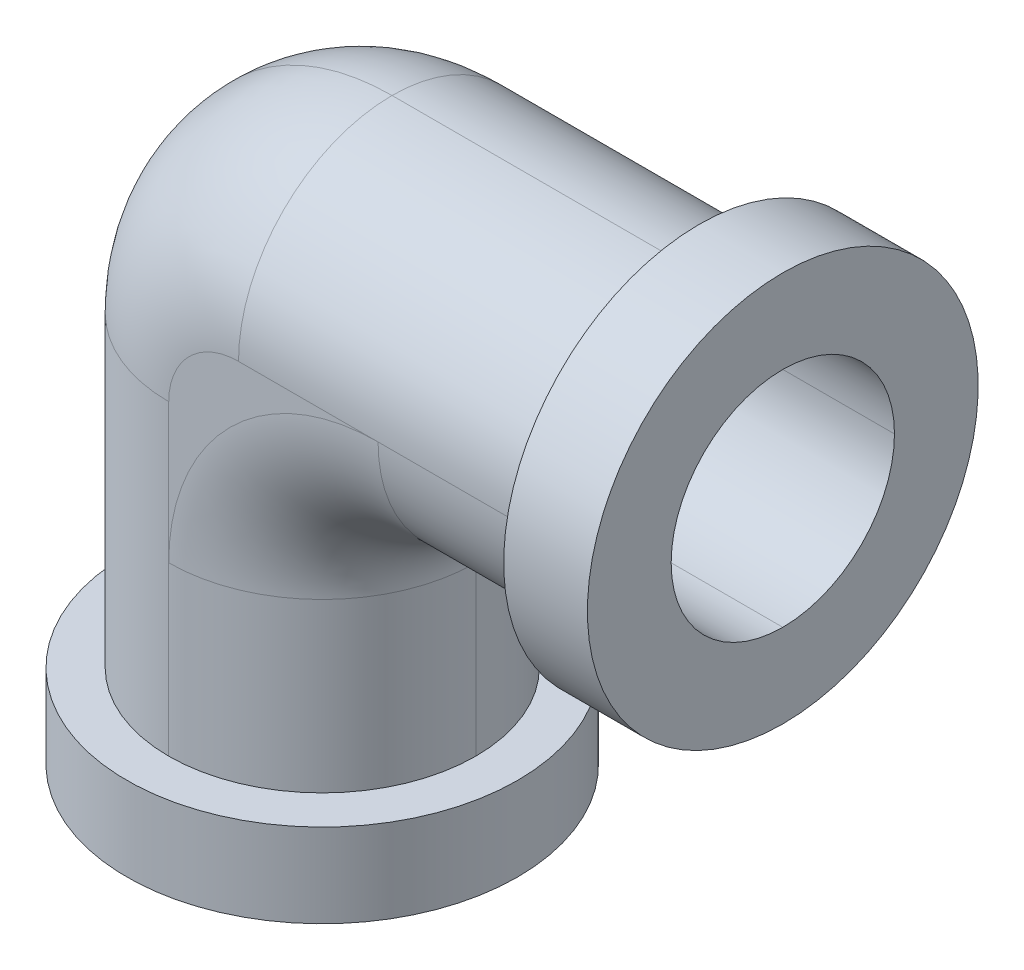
ISO-10303-21;
HEADER;
FILE_DESCRIPTION(('STEP AP214'),'2;1');
FILE_NAME('part.step','',(''),(''),'','','');
FILE_SCHEMA(('AUTOMOTIVE_DESIGN { 1 0 10303 214 1 1 1 1 }'));
ENDSEC;
DATA;
#1=APPLICATION_CONTEXT('core data for automotive mechanical design processes');
#2=APPLICATION_PROTOCOL_DEFINITION('international standard','automotive_design',2000,#1);
#3=PRODUCT_CONTEXT('',#1,'mechanical');
#4=PRODUCT('Part','Part','',(#3));
#5=PRODUCT_RELATED_PRODUCT_CATEGORY('part','',(#4));
#6=PRODUCT_DEFINITION_FORMATION('','',#4);
#7=PRODUCT_DEFINITION_CONTEXT('part definition',#1,'design');
#8=PRODUCT_DEFINITION('design','',#6,#7);
#9=PRODUCT_DEFINITION_SHAPE('','',#8);
#10=(LENGTH_UNIT() NAMED_UNIT(*) SI_UNIT(.MILLI.,.METRE.));
#11=(NAMED_UNIT(*) PLANE_ANGLE_UNIT() SI_UNIT($,.RADIAN.));
#12=(NAMED_UNIT(*) SI_UNIT($,.STERADIAN.) SOLID_ANGLE_UNIT());
#13=UNCERTAINTY_MEASURE_WITH_UNIT(LENGTH_MEASURE(1.E-05),#10,'distance_accuracy_value','');
#14=(GEOMETRIC_REPRESENTATION_CONTEXT(3) GLOBAL_UNCERTAINTY_ASSIGNED_CONTEXT((#13)) GLOBAL_UNIT_ASSIGNED_CONTEXT((#10,
#11,#12)) REPRESENTATION_CONTEXT('',''));
#15=CARTESIAN_POINT('',(0.,0.,0.));
#16=DIRECTION('',(0.,0.,1.));
#17=DIRECTION('',(1.,0.,0.));
#18=AXIS2_PLACEMENT_3D('',#15,#16,#17);
#19=CARTESIAN_POINT('',(5.5,14.,5.5));
#20=DIRECTION('',(0.,-1.,0.));
#21=DIRECTION('',(0.,0.,-1.));
#22=AXIS2_PLACEMENT_3D('',#19,#20,#21);
#23=CYLINDRICAL_SURFACE('',#22,5.5);
#24=DIRECTION('',(0.,-1.,0.));
#25=VECTOR('',#24,1.);
#26=CARTESIAN_POINT('',(0.,0.,5.5));
#27=LINE('',#26,#25);
#28=CARTESIAN_POINT('',(0.,3.,5.5));
#29=VERTEX_POINT('',#28);
#30=CARTESIAN_POINT('',(0.,14.,5.5));
#31=VERTEX_POINT('',#30);
#32=EDGE_CURVE('E205',#29,#31,#27,.F.);
#33=ORIENTED_EDGE('',*,*,#32,.F.);
#34=CARTESIAN_POINT('',(5.5,3.,5.5));
#35=DIRECTION('',(0.,-1.,0.));
#36=DIRECTION('',(1.,0.,0.));
#37=AXIS2_PLACEMENT_3D('',#34,#35,#36);
#38=CIRCLE('',#37,5.5);
#39=CARTESIAN_POINT('',(5.5,3.,11.));
#40=VERTEX_POINT('',#39);
#41=EDGE_CURVE('E184',#40,#29,#38,.T.);
#42=ORIENTED_EDGE('',*,*,#41,.F.);
#43=DIRECTION('',(0.,-1.,0.));
#44=VECTOR('',#43,1.);
#45=CARTESIAN_POINT('',(5.5,14.,11.));
#46=LINE('',#45,#44);
#47=CARTESIAN_POINT('',(5.5,8.99999999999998,11.));
#48=VERTEX_POINT('',#47);
#49=EDGE_CURVE('E182',#48,#40,#46,.T.);
#50=ORIENTED_EDGE('',*,*,#49,.F.);
#51=DIRECTION('',(0.,-1.,0.));
#52=VECTOR('',#51,1.);
#53=CARTESIAN_POINT('',(5.5,14.,11.));
#54=LINE('',#53,#52);
#55=CARTESIAN_POINT('',(5.5,14.,11.));
#56=VERTEX_POINT('',#55);
#57=EDGE_CURVE('E260',#56,#48,#54,.T.);
#58=ORIENTED_EDGE('',*,*,#57,.F.);
#59=CARTESIAN_POINT('',(5.5,14.,5.5));
#60=DIRECTION('',(0.,-1.,0.));
#61=DIRECTION('',(0.,0.,-1.));
#62=AXIS2_PLACEMENT_3D('',#59,#60,#61);
#63=CIRCLE('',#62,5.5);
#64=EDGE_CURVE('E218',#56,#31,#63,.T.);
#65=ORIENTED_EDGE('',*,*,#64,.T.);
#66=EDGE_LOOP('',(#33,#42,#50,#58,#65));
#67=FACE_BOUND('',#66,.T.);
#68=ADVANCED_FACE('F33',(#67),#23,.T.);
#69=CARTESIAN_POINT('',(5.5,0.,5.5));
#70=DIRECTION('',(0.,1.,0.));
#71=DIRECTION('',(0.,0.,1.));
#72=AXIS2_PLACEMENT_3D('',#69,#70,#71);
#73=CYLINDRICAL_SURFACE('',#72,5.5);
#74=DIRECTION('',(0.,-1.,0.));
#75=VECTOR('',#74,1.);
#76=CARTESIAN_POINT('',(5.5,14.,0.));
#77=LINE('',#76,#75);
#78=CARTESIAN_POINT('',(5.5,3.,0.));
#79=VERTEX_POINT('',#78);
#80=CARTESIAN_POINT('',(5.5,8.99999999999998,0.));
#81=VERTEX_POINT('',#80);
#82=EDGE_CURVE('E189',#79,#81,#77,.F.);
#83=ORIENTED_EDGE('',*,*,#82,.F.);
#84=EDGE_CURVE('E48',#29,#79,#38,.T.);
#85=ORIENTED_EDGE('',*,*,#84,.F.);
#86=ORIENTED_EDGE('',*,*,#32,.T.);
#87=CARTESIAN_POINT('',(5.5,14.,5.5));
#88=DIRECTION('',(0.,-1.,0.));
#89=DIRECTION('',(0.,0.,-1.));
#90=AXIS2_PLACEMENT_3D('',#87,#88,#89);
#91=CIRCLE('',#90,5.5);
#92=CARTESIAN_POINT('',(5.5,14.,0.));
#93=VERTEX_POINT('',#92);
#94=EDGE_CURVE('E207',#31,#93,#91,.T.);
#95=ORIENTED_EDGE('',*,*,#94,.T.);
#96=DIRECTION('',(0.,-1.,0.));
#97=VECTOR('',#96,1.);
#98=CARTESIAN_POINT('',(5.5,14.,0.));
#99=LINE('',#98,#97);
#100=EDGE_CURVE('E272',#81,#93,#99,.F.);
#101=ORIENTED_EDGE('',*,*,#100,.F.);
#102=EDGE_LOOP('',(#83,#85,#86,#95,#101));
#103=FACE_BOUND('',#102,.T.);
#104=ADVANCED_FACE('F398',(#103),#73,.T.);
#105=CARTESIAN_POINT('',(5.5,14.,5.5));
#106=DIRECTION('',(0.,1.,0.));
#107=DIRECTION('',(-1.,0.,0.));
#108=AXIS2_PLACEMENT_3D('',#105,#106,#107);
#109=CYLINDRICAL_SURFACE('',#108,5.5);
#110=ORIENTED_EDGE('',*,*,#49,.T.);
#111=CARTESIAN_POINT('',(11.,3.,5.5));
#112=VERTEX_POINT('',#111);
#113=EDGE_CURVE('E169',#112,#40,#38,.T.);
#114=ORIENTED_EDGE('',*,*,#113,.F.);
#115=DIRECTION('',(0.,1.,0.));
#116=VECTOR('',#115,1.);
#117=CARTESIAN_POINT('',(11.,8.99999999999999,5.5));
#118=LINE('',#117,#116);
#119=CARTESIAN_POINT('',(11.,8.99999999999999,5.5));
#120=VERTEX_POINT('',#119);
#121=EDGE_CURVE('E179',#120,#112,#118,.F.);
#122=ORIENTED_EDGE('',*,*,#121,.F.);
#123=CARTESIAN_POINT('',(5.5,8.99999999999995,5.5));
#124=DIRECTION('',(0.,-1.,0.));
#125=DIRECTION('',(1.,0.,0.));
#126=AXIS2_PLACEMENT_3D('',#123,#124,#125);
#127=CIRCLE('',#126,5.5);
#128=EDGE_CURVE('E202',#120,#48,#127,.T.);
#129=ORIENTED_EDGE('',*,*,#128,.T.);
#130=EDGE_LOOP('',(#110,#114,#122,#129));
#131=FACE_BOUND('',#130,.T.);
#132=ADVANCED_FACE('F177',(#131),#109,.T.);
#133=CARTESIAN_POINT('',(5.5,8.99999999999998,5.5));
#134=DIRECTION('',(0.,-1.,0.));
#135=DIRECTION('',(1.,0.,0.));
#136=AXIS2_PLACEMENT_3D('',#133,#134,#135);
#137=CYLINDRICAL_SURFACE('',#136,5.5);
#138=ORIENTED_EDGE('',*,*,#121,.T.);
#139=CARTESIAN_POINT('',(5.5,3.,5.5));
#140=DIRECTION('',(0.,-1.,0.));
#141=DIRECTION('',(1.,0.,0.));
#142=AXIS2_PLACEMENT_3D('',#139,#140,#141);
#143=CIRCLE('',#142,5.5);
#144=EDGE_CURVE('E11',#112,#79,#143,.F.);
#145=ORIENTED_EDGE('',*,*,#144,.T.);
#146=ORIENTED_EDGE('',*,*,#82,.T.);
#147=CARTESIAN_POINT('',(5.5,8.99999999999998,5.5));
#148=DIRECTION('',(0.,-1.,0.));
#149=DIRECTION('',(1.,0.,0.));
#150=AXIS2_PLACEMENT_3D('',#147,#148,#149);
#151=CIRCLE('',#150,5.5);
#152=EDGE_CURVE('E188',#81,#120,#151,.T.);
#153=ORIENTED_EDGE('',*,*,#152,.T.);
#154=EDGE_LOOP('',(#138,#145,#146,#153));
#155=FACE_BOUND('',#154,.T.);
#156=ADVANCED_FACE('F186',(#155),#137,.T.);
#157=CARTESIAN_POINT('',(8.,16.5,5.5));
#158=DIRECTION('',(-1.,0.,0.));
#159=DIRECTION('',(0.,-1.,0.));
#160=AXIS2_PLACEMENT_3D('',#157,#158,#159);
#161=CYLINDRICAL_SURFACE('',#160,5.5);
#162=DIRECTION('',(-1.,0.,0.));
#163=VECTOR('',#162,1.);
#164=CARTESIAN_POINT('',(8.,16.5,11.));
#165=LINE('',#164,#163);
#166=CARTESIAN_POINT('',(19.,16.5,11.));
#167=VERTEX_POINT('',#166);
#168=CARTESIAN_POINT('',(13.,16.5,11.));
#169=VERTEX_POINT('',#168);
#170=EDGE_CURVE('E230',#167,#169,#165,.T.);
#171=ORIENTED_EDGE('',*,*,#170,.F.);
#172=CARTESIAN_POINT('',(19.,16.5,5.5));
#173=DIRECTION('',(1.,0.,0.));
#174=DIRECTION('',(0.,1.,0.));
#175=AXIS2_PLACEMENT_3D('',#172,#173,#174);
#176=CIRCLE('',#175,5.5);
#177=CARTESIAN_POINT('',(19.,22.,5.5));
#178=VERTEX_POINT('',#177);
#179=EDGE_CURVE('E345',#178,#167,#176,.T.);
#180=ORIENTED_EDGE('',*,*,#179,.F.);
#181=DIRECTION('',(-1.,0.,0.));
#182=VECTOR('',#181,1.);
#183=CARTESIAN_POINT('',(8.,22.,5.5));
#184=LINE('',#183,#182);
#185=CARTESIAN_POINT('',(8.,22.,5.5));
#186=VERTEX_POINT('',#185);
#187=EDGE_CURVE('E227',#186,#178,#184,.F.);
#188=ORIENTED_EDGE('',*,*,#187,.F.);
#189=CARTESIAN_POINT('',(8.,16.5,5.5));
#190=DIRECTION('',(-1.,0.,0.));
#191=DIRECTION('',(0.,0.,1.));
#192=AXIS2_PLACEMENT_3D('',#189,#190,#191);
#193=CIRCLE('',#192,5.5);
#194=CARTESIAN_POINT('',(8.,16.5,11.));
#195=VERTEX_POINT('',#194);
#196=EDGE_CURVE('E232',#195,#186,#193,.T.);
#197=ORIENTED_EDGE('',*,*,#196,.F.);
#198=DIRECTION('',(-1.,0.,0.));
#199=VECTOR('',#198,1.);
#200=CARTESIAN_POINT('',(8.,16.5,11.));
#201=LINE('',#200,#199);
#202=EDGE_CURVE('E267',#169,#195,#201,.T.);
#203=ORIENTED_EDGE('',*,*,#202,.F.);
#204=EDGE_LOOP('',(#171,#180,#188,#197,#203));
#205=FACE_BOUND('',#204,.T.);
#206=ADVANCED_FACE('F35',(#205),#161,.T.);
#207=CARTESIAN_POINT('',(8.,16.5,5.5));
#208=DIRECTION('',(1.,0.,0.));
#209=DIRECTION('',(0.,1.,0.));
#210=AXIS2_PLACEMENT_3D('',#207,#208,#209);
#211=CYLINDRICAL_SURFACE('',#210,5.5);
#212=DIRECTION('',(1.,0.,0.));
#213=VECTOR('',#212,1.);
#214=CARTESIAN_POINT('',(22.,11.,5.5));
#215=LINE('',#214,#213);
#216=CARTESIAN_POINT('',(19.,11.,5.5));
#217=VERTEX_POINT('',#216);
#218=CARTESIAN_POINT('',(13.,11.,5.5));
#219=VERTEX_POINT('',#218);
#220=EDGE_CURVE('E213',#217,#219,#215,.F.);
#221=ORIENTED_EDGE('',*,*,#220,.F.);
#222=EDGE_CURVE('E55',#167,#217,#176,.T.);
#223=ORIENTED_EDGE('',*,*,#222,.F.);
#224=ORIENTED_EDGE('',*,*,#170,.T.);
#225=CARTESIAN_POINT('',(13.,16.5,5.5));
#226=DIRECTION('',(-1.,0.,0.));
#227=DIRECTION('',(0.,0.,1.));
#228=AXIS2_PLACEMENT_3D('',#225,#226,#227);
#229=CIRCLE('',#228,5.5);
#230=EDGE_CURVE('E215',#219,#169,#229,.T.);
#231=ORIENTED_EDGE('',*,*,#230,.F.);
#232=EDGE_LOOP('',(#221,#223,#224,#231));
#233=FACE_BOUND('',#232,.T.);
#234=ADVANCED_FACE('F388',(#233),#211,.T.);
#235=CARTESIAN_POINT('',(8.,16.5,5.5));
#236=DIRECTION('',(1.,0.,0.));
#237=DIRECTION('',(0.,1.,0.));
#238=AXIS2_PLACEMENT_3D('',#235,#236,#237);
#239=CYLINDRICAL_SURFACE('',#238,5.5);
#240=ORIENTED_EDGE('',*,*,#187,.T.);
#241=CARTESIAN_POINT('',(19.,16.5,0.));
#242=VERTEX_POINT('',#241);
#243=EDGE_CURVE('E349',#242,#178,#176,.T.);
#244=ORIENTED_EDGE('',*,*,#243,.F.);
#245=DIRECTION('',(-1.,0.,0.));
#246=VECTOR('',#245,1.);
#247=CARTESIAN_POINT('',(22.,16.5,0.));
#248=LINE('',#247,#246);
#249=CARTESIAN_POINT('',(13.,16.5,0.));
#250=VERTEX_POINT('',#249);
#251=EDGE_CURVE('E210',#250,#242,#248,.F.);
#252=ORIENTED_EDGE('',*,*,#251,.F.);
#253=DIRECTION('',(-1.,0.,0.));
#254=VECTOR('',#253,1.);
#255=CARTESIAN_POINT('',(22.,16.5,0.));
#256=LINE('',#255,#254);
#257=CARTESIAN_POINT('',(8.,16.5,0.));
#258=VERTEX_POINT('',#257);
#259=EDGE_CURVE('E234',#258,#250,#256,.F.);
#260=ORIENTED_EDGE('',*,*,#259,.F.);
#261=CARTESIAN_POINT('',(8.,16.5,5.5));
#262=DIRECTION('',(-1.,0.,0.));
#263=DIRECTION('',(0.,0.,1.));
#264=AXIS2_PLACEMENT_3D('',#261,#262,#263);
#265=CIRCLE('',#264,5.5);
#266=EDGE_CURVE('E224',#186,#258,#265,.T.);
#267=ORIENTED_EDGE('',*,*,#266,.F.);
#268=EDGE_LOOP('',(#240,#244,#252,#260,#267));
#269=FACE_BOUND('',#268,.T.);
#270=ADVANCED_FACE('F368',(#269),#239,.T.);
#271=CARTESIAN_POINT('',(22.,16.5,5.5));
#272=DIRECTION('',(-1.,0.,0.));
#273=DIRECTION('',(0.,-1.,0.));
#274=AXIS2_PLACEMENT_3D('',#271,#272,#273);
#275=CYLINDRICAL_SURFACE('',#274,5.5);
#276=ORIENTED_EDGE('',*,*,#251,.T.);
#277=CARTESIAN_POINT('',(19.,16.5,5.5));
#278=DIRECTION('',(1.,0.,0.));
#279=DIRECTION('',(0.,1.,0.));
#280=AXIS2_PLACEMENT_3D('',#277,#278,#279);
#281=CIRCLE('',#280,5.5);
#282=EDGE_CURVE('E41',#242,#217,#281,.F.);
#283=ORIENTED_EDGE('',*,*,#282,.T.);
#284=ORIENTED_EDGE('',*,*,#220,.T.);
#285=CARTESIAN_POINT('',(13.0000000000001,16.5,5.5));
#286=DIRECTION('',(-1.,0.,0.));
#287=DIRECTION('',(0.,-1.,0.));
#288=AXIS2_PLACEMENT_3D('',#285,#286,#287);
#289=CIRCLE('',#288,5.5);
#290=EDGE_CURVE('E191',#250,#219,#289,.T.);
#291=ORIENTED_EDGE('',*,*,#290,.F.);
#292=EDGE_LOOP('',(#276,#283,#284,#291));
#293=FACE_BOUND('',#292,.T.);
#294=ADVANCED_FACE('F390',(#293),#275,.T.);
#295=CARTESIAN_POINT('',(22.,22.,11.));
#296=DIRECTION('',(-1.,0.,0.));
#297=DIRECTION('',(0.,-1.,0.));
#298=AXIS2_PLACEMENT_3D('',#295,#296,#297);
#299=PLANE('',#298);
#300=CARTESIAN_POINT('',(22.,16.5,5.5));
#301=DIRECTION('',(-1.,0.,0.));
#302=DIRECTION('',(0.,-1.,0.));
#303=AXIS2_PLACEMENT_3D('',#300,#301,#302);
#304=CIRCLE('',#303,4.);
#305=CARTESIAN_POINT('',(22.,16.5,9.5));
#306=VERTEX_POINT('',#305);
#307=CARTESIAN_POINT('',(22.,12.5,5.5));
#308=VERTEX_POINT('',#307);
#309=EDGE_CURVE('E280',#306,#308,#304,.F.);
#310=ORIENTED_EDGE('',*,*,#309,.F.);
#311=CARTESIAN_POINT('',(22.,16.5,5.5));
#312=DIRECTION('',(-1.,0.,0.));
#313=DIRECTION('',(0.,-1.,0.));
#314=AXIS2_PLACEMENT_3D('',#311,#312,#313);
#315=CIRCLE('',#314,4.);
#316=CARTESIAN_POINT('',(22.,20.5,5.5));
#317=VERTEX_POINT('',#316);
#318=EDGE_CURVE('E281',#317,#306,#315,.F.);
#319=ORIENTED_EDGE('',*,*,#318,.F.);
#320=CARTESIAN_POINT('',(22.,16.5,5.5));
#321=DIRECTION('',(-1.,0.,0.));
#322=DIRECTION('',(0.,-1.,0.));
#323=AXIS2_PLACEMENT_3D('',#320,#321,#322);
#324=CIRCLE('',#323,4.);
#325=CARTESIAN_POINT('',(22.,16.5,1.5));
#326=VERTEX_POINT('',#325);
#327=EDGE_CURVE('E277',#326,#317,#324,.F.);
#328=ORIENTED_EDGE('',*,*,#327,.F.);
#329=CARTESIAN_POINT('',(22.,16.5,5.5));
#330=DIRECTION('',(-1.,0.,0.));
#331=DIRECTION('',(0.,-1.,0.));
#332=AXIS2_PLACEMENT_3D('',#329,#330,#331);
#333=CIRCLE('',#332,4.);
#334=EDGE_CURVE('E193',#308,#326,#333,.F.);
#335=ORIENTED_EDGE('',*,*,#334,.F.);
#336=EDGE_LOOP('',(#310,#319,#328,#335));
#337=FACE_BOUND('',#336,.T.);
#338=CARTESIAN_POINT('',(22.,16.5,5.5));
#339=DIRECTION('',(1.,0.,0.));
#340=DIRECTION('',(0.,1.,0.));
#341=AXIS2_PLACEMENT_3D('',#338,#339,#340);
#342=CIRCLE('',#341,7.);
#343=CARTESIAN_POINT('',(22.,23.5,5.5));
#344=VERTEX_POINT('',#343);
#345=EDGE_CURVE('E342',#344,#344,#342,.T.);
#346=ORIENTED_EDGE('',*,*,#345,.T.);
#347=EDGE_LOOP('',(#346));
#348=FACE_BOUND('',#347,.T.);
#349=ADVANCED_FACE('F411',(#337,#348),#299,.F.);
#350=CARTESIAN_POINT('',(11.,0.,11.));
#351=DIRECTION('',(0.,1.,0.));
#352=DIRECTION('',(-1.,0.,0.));
#353=AXIS2_PLACEMENT_3D('',#350,#351,#352);
#354=PLANE('',#353);
#355=CARTESIAN_POINT('',(5.5,0.,5.5));
#356=DIRECTION('',(0.,-1.,0.));
#357=DIRECTION('',(1.,0.,0.));
#358=AXIS2_PLACEMENT_3D('',#355,#356,#357);
#359=CIRCLE('',#358,4.);
#360=CARTESIAN_POINT('',(9.5,0.,5.5));
#361=VERTEX_POINT('',#360);
#362=EDGE_CURVE('E299',#361,#361,#359,.T.);
#363=ORIENTED_EDGE('',*,*,#362,.F.);
#364=EDGE_LOOP('',(#363));
#365=FACE_BOUND('',#364,.T.);
#366=CARTESIAN_POINT('',(5.5,0.,5.5));
#367=DIRECTION('',(0.,-1.,0.));
#368=DIRECTION('',(1.,0.,0.));
#369=AXIS2_PLACEMENT_3D('',#366,#367,#368);
#370=CIRCLE('',#369,7.);
#371=CARTESIAN_POINT('',(12.5,0.,5.5));
#372=VERTEX_POINT('',#371);
#373=EDGE_CURVE('E183',#372,#372,#370,.T.);
#374=ORIENTED_EDGE('',*,*,#373,.T.);
#375=EDGE_LOOP('',(#374));
#376=FACE_BOUND('',#375,.T.);
#377=ADVANCED_FACE('F427',(#365,#376),#354,.F.);
#378=CARTESIAN_POINT('',(8.,14.,11.));
#379=DIRECTION('',(0.,0.,-1.));
#380=DIRECTION('',(-1.,0.,0.));
#381=AXIS2_PLACEMENT_3D('',#378,#379,#380);
#382=PLANE('',#381);
#383=ORIENTED_EDGE('',*,*,#57,.T.);
#384=CARTESIAN_POINT('',(13.,9.,11.));
#385=DIRECTION('',(0.,0.,-1.));
#386=DIRECTION('',(-1.,0.,0.));
#387=AXIS2_PLACEMENT_3D('',#384,#385,#386);
#388=CIRCLE('',#387,7.5);
#389=EDGE_CURVE('E256',#48,#169,#388,.T.);
#390=ORIENTED_EDGE('',*,*,#389,.T.);
#391=ORIENTED_EDGE('',*,*,#202,.T.);
#392=CARTESIAN_POINT('',(8.,14.,11.));
#393=DIRECTION('',(0.,0.,-1.));
#394=DIRECTION('',(-1.,0.,0.));
#395=AXIS2_PLACEMENT_3D('',#392,#393,#394);
#396=CIRCLE('',#395,2.5);
#397=EDGE_CURVE('E263',#195,#56,#396,.F.);
#398=ORIENTED_EDGE('',*,*,#397,.T.);
#399=EDGE_LOOP('',(#383,#390,#391,#398));
#400=FACE_BOUND('',#399,.T.);
#401=ADVANCED_FACE('F382',(#400),#382,.F.);
#402=CARTESIAN_POINT('',(8.,14.,0.));
#403=DIRECTION('',(0.,0.,-1.));
#404=DIRECTION('',(-1.,0.,0.));
#405=AXIS2_PLACEMENT_3D('',#402,#403,#404);
#406=PLANE('',#405);
#407=ORIENTED_EDGE('',*,*,#259,.T.);
#408=CARTESIAN_POINT('',(13.,9.,0.));
#409=DIRECTION('',(0.,0.,-1.));
#410=DIRECTION('',(-1.,0.,0.));
#411=AXIS2_PLACEMENT_3D('',#408,#409,#410);
#412=CIRCLE('',#411,7.5);
#413=EDGE_CURVE('E269',#250,#81,#412,.F.);
#414=ORIENTED_EDGE('',*,*,#413,.T.);
#415=ORIENTED_EDGE('',*,*,#100,.T.);
#416=CARTESIAN_POINT('',(8.,14.,0.));
#417=DIRECTION('',(0.,0.,-1.));
#418=DIRECTION('',(-1.,0.,0.));
#419=AXIS2_PLACEMENT_3D('',#416,#417,#418);
#420=CIRCLE('',#419,2.5);
#421=EDGE_CURVE('E274',#93,#258,#420,.T.);
#422=ORIENTED_EDGE('',*,*,#421,.T.);
#423=EDGE_LOOP('',(#407,#414,#415,#422));
#424=FACE_BOUND('',#423,.T.);
#425=ADVANCED_FACE('F396',(#424),#406,.T.);
#426=CARTESIAN_POINT('',(8.,14.,5.5));
#427=DIRECTION('',(0.,0.,-1.));
#428=DIRECTION('',(-1.,0.,0.));
#429=AXIS2_PLACEMENT_3D('',#426,#427,#428);
#430=DEGENERATE_TOROIDAL_SURFACE('',#429,2.5,5.5,.T.);
#431=ORIENTED_EDGE('',*,*,#397,.F.);
#432=ORIENTED_EDGE('',*,*,#196,.T.);
#433=CARTESIAN_POINT('',(8.,14.,5.5));
#434=DIRECTION('',(0.,0.,-1.));
#435=DIRECTION('',(-1.,0.,0.));
#436=AXIS2_PLACEMENT_3D('',#433,#434,#435);
#437=CIRCLE('',#436,8.);
#438=EDGE_CURVE('E221',#31,#186,#437,.T.);
#439=ORIENTED_EDGE('',*,*,#438,.F.);
#440=ORIENTED_EDGE('',*,*,#64,.F.);
#441=EDGE_LOOP('',(#431,#432,#439,#440));
#442=FACE_BOUND('',#441,.T.);
#443=ADVANCED_FACE('F378',(#442),#430,.T.);
#444=CARTESIAN_POINT('',(8.,14.,5.5));
#445=DIRECTION('',(0.,0.,-1.));
#446=DIRECTION('',(-1.,0.,0.));
#447=AXIS2_PLACEMENT_3D('',#444,#445,#446);
#448=DEGENERATE_TOROIDAL_SURFACE('',#447,2.5,5.5,.T.);
#449=ORIENTED_EDGE('',*,*,#266,.T.);
#450=ORIENTED_EDGE('',*,*,#421,.F.);
#451=ORIENTED_EDGE('',*,*,#94,.F.);
#452=ORIENTED_EDGE('',*,*,#438,.T.);
#453=EDGE_LOOP('',(#449,#450,#451,#452));
#454=FACE_BOUND('',#453,.T.);
#455=ADVANCED_FACE('F374',(#454),#448,.T.);
#456=CARTESIAN_POINT('',(13.,9.,5.5));
#457=DIRECTION('',(0.,0.,-1.));
#458=DIRECTION('',(-1.,0.,0.));
#459=AXIS2_PLACEMENT_3D('',#456,#457,#458);
#460=TOROIDAL_SURFACE('',#459,7.5,5.5);
#461=ORIENTED_EDGE('',*,*,#230,.T.);
#462=ORIENTED_EDGE('',*,*,#389,.F.);
#463=ORIENTED_EDGE('',*,*,#128,.F.);
#464=CARTESIAN_POINT('',(13.,9.,5.5));
#465=DIRECTION('',(0.,0.,-1.));
#466=DIRECTION('',(-1.,0.,0.));
#467=AXIS2_PLACEMENT_3D('',#464,#465,#466);
#468=CIRCLE('',#467,2.);
#469=EDGE_CURVE('E199',#219,#120,#468,.F.);
#470=ORIENTED_EDGE('',*,*,#469,.F.);
#471=EDGE_LOOP('',(#461,#462,#463,#470));
#472=FACE_BOUND('',#471,.T.);
#473=ADVANCED_FACE('F384',(#472),#460,.T.);
#474=CARTESIAN_POINT('',(13.,9.,5.5));
#475=DIRECTION('',(0.,0.,-1.));
#476=DIRECTION('',(-1.,0.,0.));
#477=AXIS2_PLACEMENT_3D('',#474,#475,#476);
#478=TOROIDAL_SURFACE('',#477,7.5,5.5);
#479=ORIENTED_EDGE('',*,*,#290,.T.);
#480=ORIENTED_EDGE('',*,*,#469,.T.);
#481=ORIENTED_EDGE('',*,*,#152,.F.);
#482=ORIENTED_EDGE('',*,*,#413,.F.);
#483=EDGE_LOOP('',(#479,#480,#481,#482));
#484=FACE_BOUND('',#483,.T.);
#485=ADVANCED_FACE('F393',(#484),#478,.T.);
#486=CARTESIAN_POINT('',(8.,14.,9.5));
#487=DIRECTION('',(0.,0.,-1.));
#488=DIRECTION('',(-1.,0.,0.));
#489=AXIS2_PLACEMENT_3D('',#486,#487,#488);
#490=PLANE('',#489);
#491=DIRECTION('',(0.,1.,0.));
#492=VECTOR('',#491,1.);
#493=CARTESIAN_POINT('',(5.5,14.,9.5));
#494=LINE('',#493,#492);
#495=CARTESIAN_POINT('',(5.5,14.,9.5));
#496=VERTEX_POINT('',#495);
#497=CARTESIAN_POINT('',(5.5,8.99999999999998,9.5));
#498=VERTEX_POINT('',#497);
#499=EDGE_CURVE('E332',#496,#498,#494,.F.);
#500=ORIENTED_EDGE('',*,*,#499,.F.);
#501=CARTESIAN_POINT('',(8.,14.,9.5));
#502=DIRECTION('',(0.,0.,-1.));
#503=DIRECTION('',(-1.,0.,0.));
#504=AXIS2_PLACEMENT_3D('',#501,#502,#503);
#505=CIRCLE('',#504,2.5);
#506=CARTESIAN_POINT('',(8.,16.5,9.5));
#507=VERTEX_POINT('',#506);
#508=EDGE_CURVE('E330',#507,#496,#505,.F.);
#509=ORIENTED_EDGE('',*,*,#508,.F.);
#510=DIRECTION('',(-1.,0.,0.));
#511=VECTOR('',#510,1.);
#512=CARTESIAN_POINT('',(8.,16.5,9.5));
#513=LINE('',#512,#511);
#514=CARTESIAN_POINT('',(13.,16.5,9.5));
#515=VERTEX_POINT('',#514);
#516=EDGE_CURVE('E314',#515,#507,#513,.T.);
#517=ORIENTED_EDGE('',*,*,#516,.F.);
#518=CARTESIAN_POINT('',(13.,9.,9.5));
#519=DIRECTION('',(0.,0.,-1.));
#520=DIRECTION('',(-1.,0.,0.));
#521=AXIS2_PLACEMENT_3D('',#518,#519,#520);
#522=CIRCLE('',#521,7.5);
#523=EDGE_CURVE('E286',#498,#515,#522,.T.);
#524=ORIENTED_EDGE('',*,*,#523,.F.);
#525=EDGE_LOOP('',(#500,#509,#517,#524));
#526=FACE_BOUND('',#525,.T.);
#527=ADVANCED_FACE('F439',(#526),#490,.T.);
#528=CARTESIAN_POINT('',(8.,14.,1.5));
#529=DIRECTION('',(0.,0.,-1.));
#530=DIRECTION('',(-1.,0.,0.));
#531=AXIS2_PLACEMENT_3D('',#528,#529,#530);
#532=PLANE('',#531);
#533=DIRECTION('',(-1.,0.,0.));
#534=VECTOR('',#533,1.);
#535=CARTESIAN_POINT('',(8.,16.5,1.5));
#536=LINE('',#535,#534);
#537=CARTESIAN_POINT('',(8.,16.5,1.5));
#538=VERTEX_POINT('',#537);
#539=CARTESIAN_POINT('',(13.,16.5,1.5));
#540=VERTEX_POINT('',#539);
#541=EDGE_CURVE('E309',#538,#540,#536,.F.);
#542=ORIENTED_EDGE('',*,*,#541,.F.);
#543=CARTESIAN_POINT('',(8.,14.,1.5));
#544=DIRECTION('',(0.,0.,-1.));
#545=DIRECTION('',(-1.,0.,0.));
#546=AXIS2_PLACEMENT_3D('',#543,#544,#545);
#547=CIRCLE('',#546,2.5);
#548=CARTESIAN_POINT('',(5.5,14.,1.5));
#549=VERTEX_POINT('',#548);
#550=EDGE_CURVE('E306',#549,#538,#547,.T.);
#551=ORIENTED_EDGE('',*,*,#550,.F.);
#552=DIRECTION('',(0.,1.,0.));
#553=VECTOR('',#552,1.);
#554=CARTESIAN_POINT('',(5.5,14.,1.5));
#555=LINE('',#554,#553);
#556=CARTESIAN_POINT('',(5.5,8.99999999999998,1.5));
#557=VERTEX_POINT('',#556);
#558=EDGE_CURVE('E308',#557,#549,#555,.T.);
#559=ORIENTED_EDGE('',*,*,#558,.F.);
#560=CARTESIAN_POINT('',(13.,9.,1.5));
#561=DIRECTION('',(0.,0.,-1.));
#562=DIRECTION('',(-1.,0.,0.));
#563=AXIS2_PLACEMENT_3D('',#560,#561,#562);
#564=CIRCLE('',#563,7.5);
#565=EDGE_CURVE('E311',#540,#557,#564,.F.);
#566=ORIENTED_EDGE('',*,*,#565,.F.);
#567=EDGE_LOOP('',(#542,#551,#559,#566));
#568=FACE_BOUND('',#567,.T.);
#569=ADVANCED_FACE('F443',(#568),#532,.F.);
#570=CARTESIAN_POINT('',(8.,16.5,5.5));
#571=DIRECTION('',(-1.,0.,0.));
#572=DIRECTION('',(0.,-1.,0.));
#573=AXIS2_PLACEMENT_3D('',#570,#571,#572);
#574=CYLINDRICAL_SURFACE('',#573,4.);
#575=CARTESIAN_POINT('',(8.,16.5,5.5));
#576=DIRECTION('',(-1.,0.,0.));
#577=DIRECTION('',(0.,-1.,0.));
#578=AXIS2_PLACEMENT_3D('',#575,#576,#577);
#579=CIRCLE('',#578,4.);
#580=CARTESIAN_POINT('',(8.,20.5,5.5));
#581=VERTEX_POINT('',#580);
#582=EDGE_CURVE('E321',#507,#581,#579,.T.);
#583=ORIENTED_EDGE('',*,*,#582,.T.);
#584=DIRECTION('',(1.,0.,0.));
#585=VECTOR('',#584,1.);
#586=CARTESIAN_POINT('',(8.,20.5,5.5));
#587=LINE('',#586,#585);
#588=EDGE_CURVE('E318',#581,#317,#587,.T.);
#589=ORIENTED_EDGE('',*,*,#588,.T.);
#590=ORIENTED_EDGE('',*,*,#318,.T.);
#591=DIRECTION('',(1.,0.,0.));
#592=VECTOR('',#591,1.);
#593=CARTESIAN_POINT('',(8.,16.5,9.5));
#594=LINE('',#593,#592);
#595=EDGE_CURVE('E326',#306,#515,#594,.F.);
#596=ORIENTED_EDGE('',*,*,#595,.T.);
#597=ORIENTED_EDGE('',*,*,#516,.T.);
#598=EDGE_LOOP('',(#583,#589,#590,#596,#597));
#599=FACE_BOUND('',#598,.T.);
#600=ADVANCED_FACE('F449',(#599),#574,.F.);
#601=CARTESIAN_POINT('',(8.,14.,5.5));
#602=DIRECTION('',(0.,0.,-1.));
#603=DIRECTION('',(-1.,0.,0.));
#604=AXIS2_PLACEMENT_3D('',#601,#602,#603);
#605=DEGENERATE_TOROIDAL_SURFACE('',#604,2.5,4.,.T.);
#606=ORIENTED_EDGE('',*,*,#508,.T.);
#607=CARTESIAN_POINT('',(5.5,14.,5.5));
#608=DIRECTION('',(0.,-1.,0.));
#609=DIRECTION('',(0.,0.,-1.));
#610=AXIS2_PLACEMENT_3D('',#607,#608,#609);
#611=CIRCLE('',#610,4.);
#612=CARTESIAN_POINT('',(1.5,14.,5.5));
#613=VERTEX_POINT('',#612);
#614=EDGE_CURVE('E296',#496,#613,#611,.T.);
#615=ORIENTED_EDGE('',*,*,#614,.T.);
#616=CARTESIAN_POINT('',(8.,14.,5.5));
#617=DIRECTION('',(0.,0.,-1.));
#618=DIRECTION('',(-1.,0.,0.));
#619=AXIS2_PLACEMENT_3D('',#616,#617,#618);
#620=CIRCLE('',#619,6.5);
#621=EDGE_CURVE('E319',#613,#581,#620,.T.);
#622=ORIENTED_EDGE('',*,*,#621,.T.);
#623=ORIENTED_EDGE('',*,*,#582,.F.);
#624=EDGE_LOOP('',(#606,#615,#622,#623));
#625=FACE_BOUND('',#624,.T.);
#626=ADVANCED_FACE('F459',(#625),#605,.F.);
#627=CARTESIAN_POINT('',(8.,16.5,5.5));
#628=DIRECTION('',(1.,0.,0.));
#629=DIRECTION('',(0.,1.,0.));
#630=AXIS2_PLACEMENT_3D('',#627,#628,#629);
#631=CYLINDRICAL_SURFACE('',#630,4.);
#632=ORIENTED_EDGE('',*,*,#309,.T.);
#633=DIRECTION('',(-1.,0.,0.));
#634=VECTOR('',#633,1.);
#635=CARTESIAN_POINT('',(22.,12.5,5.5));
#636=LINE('',#635,#634);
#637=CARTESIAN_POINT('',(13.,12.5,5.5));
#638=VERTEX_POINT('',#637);
#639=EDGE_CURVE('E290',#308,#638,#636,.T.);
#640=ORIENTED_EDGE('',*,*,#639,.T.);
#641=CARTESIAN_POINT('',(13.0000000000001,16.5,5.5));
#642=DIRECTION('',(-1.,0.,0.));
#643=DIRECTION('',(0.,-1.,0.));
#644=AXIS2_PLACEMENT_3D('',#641,#642,#643);
#645=CIRCLE('',#644,4.);
#646=EDGE_CURVE('E293',#638,#515,#645,.T.);
#647=ORIENTED_EDGE('',*,*,#646,.T.);
#648=ORIENTED_EDGE('',*,*,#595,.F.);
#649=EDGE_LOOP('',(#632,#640,#647,#648));
#650=FACE_BOUND('',#649,.T.);
#651=ADVANCED_FACE('F463',(#650),#631,.F.);
#652=CARTESIAN_POINT('',(8.,16.5,5.5));
#653=DIRECTION('',(1.,0.,0.));
#654=DIRECTION('',(0.,1.,0.));
#655=AXIS2_PLACEMENT_3D('',#652,#653,#654);
#656=CYLINDRICAL_SURFACE('',#655,4.);
#657=DIRECTION('',(-1.,0.,0.));
#658=VECTOR('',#657,1.);
#659=CARTESIAN_POINT('',(22.,16.5,1.5));
#660=LINE('',#659,#658);
#661=EDGE_CURVE('E294',#540,#326,#660,.F.);
#662=ORIENTED_EDGE('',*,*,#661,.T.);
#663=ORIENTED_EDGE('',*,*,#327,.T.);
#664=ORIENTED_EDGE('',*,*,#588,.F.);
#665=CARTESIAN_POINT('',(8.,16.5,5.5));
#666=DIRECTION('',(-1.,0.,0.));
#667=DIRECTION('',(0.,-1.,0.));
#668=AXIS2_PLACEMENT_3D('',#665,#666,#667);
#669=CIRCLE('',#668,4.);
#670=EDGE_CURVE('E315',#581,#538,#669,.T.);
#671=ORIENTED_EDGE('',*,*,#670,.T.);
#672=ORIENTED_EDGE('',*,*,#541,.T.);
#673=EDGE_LOOP('',(#662,#663,#664,#671,#672));
#674=FACE_BOUND('',#673,.T.);
#675=ADVANCED_FACE('F467',(#674),#656,.F.);
#676=CARTESIAN_POINT('',(8.,14.,5.5));
#677=DIRECTION('',(0.,0.,-1.));
#678=DIRECTION('',(-1.,0.,0.));
#679=AXIS2_PLACEMENT_3D('',#676,#677,#678);
#680=DEGENERATE_TOROIDAL_SURFACE('',#679,2.5,4.,.T.);
#681=ORIENTED_EDGE('',*,*,#670,.F.);
#682=ORIENTED_EDGE('',*,*,#621,.F.);
#683=CARTESIAN_POINT('',(5.5,14.,5.5));
#684=DIRECTION('',(0.,1.,0.));
#685=DIRECTION('',(0.,0.,1.));
#686=AXIS2_PLACEMENT_3D('',#683,#684,#685);
#687=CIRCLE('',#686,4.);
#688=EDGE_CURVE('E249',#613,#549,#687,.F.);
#689=ORIENTED_EDGE('',*,*,#688,.T.);
#690=ORIENTED_EDGE('',*,*,#550,.T.);
#691=EDGE_LOOP('',(#681,#682,#689,#690));
#692=FACE_BOUND('',#691,.T.);
#693=ADVANCED_FACE('F471',(#692),#680,.F.);
#694=CARTESIAN_POINT('',(5.5,14.,5.5));
#695=DIRECTION('',(0.,-1.,0.));
#696=DIRECTION('',(0.,0.,-1.));
#697=AXIS2_PLACEMENT_3D('',#694,#695,#696);
#698=CYLINDRICAL_SURFACE('',#697,4.);
#699=ORIENTED_EDGE('',*,*,#499,.T.);
#700=DIRECTION('',(0.,1.,0.));
#701=VECTOR('',#700,1.);
#702=CARTESIAN_POINT('',(5.5,14.,9.5));
#703=LINE('',#702,#701);
#704=CARTESIAN_POINT('',(5.5,1.5,9.5));
#705=VERTEX_POINT('',#704);
#706=EDGE_CURVE('E250',#498,#705,#703,.F.);
#707=ORIENTED_EDGE('',*,*,#706,.T.);
#708=ORIENTED_EDGE('',*,*,#706,.F.);
#709=CARTESIAN_POINT('',(5.5,8.99999999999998,5.5));
#710=DIRECTION('',(0.,1.,0.));
#711=DIRECTION('',(-1.,0.,0.));
#712=AXIS2_PLACEMENT_3D('',#709,#710,#711);
#713=CIRCLE('',#712,4.);
#714=CARTESIAN_POINT('',(9.5,8.99999999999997,5.5));
#715=VERTEX_POINT('',#714);
#716=EDGE_CURVE('E254',#715,#498,#713,.F.);
#717=ORIENTED_EDGE('',*,*,#716,.F.);
#718=DIRECTION('',(0.,-1.,0.));
#719=VECTOR('',#718,1.);
#720=CARTESIAN_POINT('',(9.5,8.99999999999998,5.5));
#721=LINE('',#720,#719);
#722=CARTESIAN_POINT('',(9.5,1.5,5.5));
#723=VERTEX_POINT('',#722);
#724=EDGE_CURVE('E235',#715,#723,#721,.T.);
#725=ORIENTED_EDGE('',*,*,#724,.T.);
#726=ORIENTED_EDGE('',*,*,#724,.F.);
#727=CARTESIAN_POINT('',(5.5,8.99999999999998,5.5));
#728=DIRECTION('',(0.,-1.,0.));
#729=DIRECTION('',(1.,0.,0.));
#730=AXIS2_PLACEMENT_3D('',#727,#728,#729);
#731=CIRCLE('',#730,4.);
#732=EDGE_CURVE('E238',#557,#715,#731,.T.);
#733=ORIENTED_EDGE('',*,*,#732,.F.);
#734=DIRECTION('',(0.,-1.,0.));
#735=VECTOR('',#734,1.);
#736=CARTESIAN_POINT('',(5.5,8.99999999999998,1.5));
#737=LINE('',#736,#735);
#738=CARTESIAN_POINT('',(5.5,1.5,1.5));
#739=VERTEX_POINT('',#738);
#740=EDGE_CURVE('E237',#739,#557,#737,.F.);
#741=ORIENTED_EDGE('',*,*,#740,.F.);
#742=ORIENTED_EDGE('',*,*,#740,.T.);
#743=ORIENTED_EDGE('',*,*,#558,.T.);
#744=ORIENTED_EDGE('',*,*,#688,.F.);
#745=DIRECTION('',(0.,1.,0.));
#746=VECTOR('',#745,1.);
#747=CARTESIAN_POINT('',(1.5,0.,5.5));
#748=LINE('',#747,#746);
#749=CARTESIAN_POINT('',(1.5,1.5,5.5));
#750=VERTEX_POINT('',#749);
#751=EDGE_CURVE('E246',#750,#613,#748,.T.);
#752=ORIENTED_EDGE('',*,*,#751,.F.);
#753=ORIENTED_EDGE('',*,*,#751,.T.);
#754=ORIENTED_EDGE('',*,*,#614,.F.);
#755=EDGE_LOOP('',(#699,#707,#708,#717,#725,#726,#733,#741,#742,#743,#744,#752,#753,#754));
#756=FACE_BOUND('',#755,.T.);
#757=ORIENTED_EDGE('',*,*,#362,.T.);
#758=EDGE_LOOP('',(#757));
#759=FACE_BOUND('',#758,.T.);
#760=ADVANCED_FACE('F475',(#756,#759),#698,.F.);
#761=CARTESIAN_POINT('',(13.,9.,5.5));
#762=DIRECTION('',(0.,0.,-1.));
#763=DIRECTION('',(-1.,0.,0.));
#764=AXIS2_PLACEMENT_3D('',#761,#762,#763);
#765=TOROIDAL_SURFACE('',#764,7.5,4.);
#766=ORIENTED_EDGE('',*,*,#646,.F.);
#767=CARTESIAN_POINT('',(13.,9.,5.5));
#768=DIRECTION('',(0.,0.,-1.));
#769=DIRECTION('',(-1.,0.,0.));
#770=AXIS2_PLACEMENT_3D('',#767,#768,#769);
#771=CIRCLE('',#770,3.5);
#772=EDGE_CURVE('E289',#638,#715,#771,.F.);
#773=ORIENTED_EDGE('',*,*,#772,.T.);
#774=ORIENTED_EDGE('',*,*,#716,.T.);
#775=ORIENTED_EDGE('',*,*,#523,.T.);
#776=EDGE_LOOP('',(#766,#773,#774,#775));
#777=FACE_BOUND('',#776,.T.);
#778=ADVANCED_FACE('F479',(#777),#765,.F.);
#779=CARTESIAN_POINT('',(22.,16.5,5.5));
#780=DIRECTION('',(-1.,0.,0.));
#781=DIRECTION('',(0.,-1.,0.));
#782=AXIS2_PLACEMENT_3D('',#779,#780,#781);
#783=CYLINDRICAL_SURFACE('',#782,4.);
#784=ORIENTED_EDGE('',*,*,#334,.T.);
#785=ORIENTED_EDGE('',*,*,#661,.F.);
#786=CARTESIAN_POINT('',(13.,16.5,5.5));
#787=DIRECTION('',(-1.,0.,0.));
#788=DIRECTION('',(0.,-1.,0.));
#789=AXIS2_PLACEMENT_3D('',#786,#787,#788);
#790=CIRCLE('',#789,4.);
#791=EDGE_CURVE('E243',#540,#638,#790,.T.);
#792=ORIENTED_EDGE('',*,*,#791,.T.);
#793=ORIENTED_EDGE('',*,*,#639,.F.);
#794=EDGE_LOOP('',(#784,#785,#792,#793));
#795=FACE_BOUND('',#794,.T.);
#796=ADVANCED_FACE('F483',(#795),#783,.F.);
#797=CARTESIAN_POINT('',(13.,9.,5.5));
#798=DIRECTION('',(0.,0.,-1.));
#799=DIRECTION('',(-1.,0.,0.));
#800=AXIS2_PLACEMENT_3D('',#797,#798,#799);
#801=TOROIDAL_SURFACE('',#800,7.5,4.);
#802=ORIENTED_EDGE('',*,*,#791,.F.);
#803=ORIENTED_EDGE('',*,*,#565,.T.);
#804=ORIENTED_EDGE('',*,*,#732,.T.);
#805=ORIENTED_EDGE('',*,*,#772,.F.);
#806=EDGE_LOOP('',(#802,#803,#804,#805));
#807=FACE_BOUND('',#806,.T.);
#808=ADVANCED_FACE('F486',(#807),#801,.F.);
#809=CARTESIAN_POINT('',(19.,16.5,5.5));
#810=DIRECTION('',(1.,0.,0.));
#811=DIRECTION('',(0.,1.,0.));
#812=AXIS2_PLACEMENT_3D('',#809,#810,#811);
#813=CYLINDRICAL_SURFACE('',#812,7.);
#814=CARTESIAN_POINT('',(19.,16.5,5.5));
#815=DIRECTION('',(1.,0.,0.));
#816=DIRECTION('',(0.,1.,0.));
#817=AXIS2_PLACEMENT_3D('',#814,#815,#816);
#818=CIRCLE('',#817,7.);
#819=CARTESIAN_POINT('',(19.,23.5,5.5));
#820=VERTEX_POINT('',#819);
#821=EDGE_CURVE('E341',#820,#820,#818,.T.);
#822=ORIENTED_EDGE('',*,*,#821,.T.);
#823=EDGE_LOOP('',(#822));
#824=FACE_BOUND('',#823,.T.);
#825=ORIENTED_EDGE('',*,*,#345,.F.);
#826=EDGE_LOOP('',(#825));
#827=FACE_BOUND('',#826,.T.);
#828=ADVANCED_FACE('F454',(#824,#827),#813,.T.);
#829=CARTESIAN_POINT('',(19.,16.5,5.5));
#830=DIRECTION('',(1.,0.,0.));
#831=DIRECTION('',(0.,1.,0.));
#832=AXIS2_PLACEMENT_3D('',#829,#830,#831);
#833=PLANE('',#832);
#834=ORIENTED_EDGE('',*,*,#179,.T.);
#835=ORIENTED_EDGE('',*,*,#222,.T.);
#836=ORIENTED_EDGE('',*,*,#282,.F.);
#837=ORIENTED_EDGE('',*,*,#243,.T.);
#838=EDGE_LOOP('',(#834,#835,#836,#837));
#839=FACE_BOUND('',#838,.T.);
#840=ORIENTED_EDGE('',*,*,#821,.F.);
#841=EDGE_LOOP('',(#840));
#842=FACE_BOUND('',#841,.T.);
#843=ADVANCED_FACE('F358',(#839,#842),#833,.F.);
#844=CARTESIAN_POINT('',(5.5,3.,5.5));
#845=DIRECTION('',(0.,-1.,0.));
#846=DIRECTION('',(1.,0.,0.));
#847=AXIS2_PLACEMENT_3D('',#844,#845,#846);
#848=CYLINDRICAL_SURFACE('',#847,7.);
#849=CARTESIAN_POINT('',(5.5,3.,5.5));
#850=DIRECTION('',(0.,-1.,0.));
#851=DIRECTION('',(1.,0.,0.));
#852=AXIS2_PLACEMENT_3D('',#849,#850,#851);
#853=CIRCLE('',#852,7.);
#854=CARTESIAN_POINT('',(12.5,3.,5.5));
#855=VERTEX_POINT('',#854);
#856=EDGE_CURVE('E352',#855,#855,#853,.T.);
#857=ORIENTED_EDGE('',*,*,#856,.T.);
#858=EDGE_LOOP('',(#857));
#859=FACE_BOUND('',#858,.T.);
#860=ORIENTED_EDGE('',*,*,#373,.F.);
#861=EDGE_LOOP('',(#860));
#862=FACE_BOUND('',#861,.T.);
#863=ADVANCED_FACE('F525',(#859,#862),#848,.T.);
#864=CARTESIAN_POINT('',(5.5,3.,5.5));
#865=DIRECTION('',(0.,-1.,0.));
#866=DIRECTION('',(1.,0.,0.));
#867=AXIS2_PLACEMENT_3D('',#864,#865,#866);
#868=PLANE('',#867);
#869=ORIENTED_EDGE('',*,*,#113,.T.);
#870=ORIENTED_EDGE('',*,*,#41,.T.);
#871=ORIENTED_EDGE('',*,*,#84,.T.);
#872=ORIENTED_EDGE('',*,*,#144,.F.);
#873=EDGE_LOOP('',(#869,#870,#871,#872));
#874=FACE_BOUND('',#873,.T.);
#875=ORIENTED_EDGE('',*,*,#856,.F.);
#876=EDGE_LOOP('',(#875));
#877=FACE_BOUND('',#876,.T.);
#878=ADVANCED_FACE('F167',(#874,#877),#868,.F.);
#879=CLOSED_SHELL('',(#68,#104,#132,#156,#206,#234,#270,#294,#349,#377,#401,#425,#443,#455,#473,
#485,#527,#569,#600,#626,#651,#675,#693,#760,#778,#796,#808,#828,#843,#863,#878));
#880=MANIFOLD_SOLID_BREP('B2',#879);
#881=ADVANCED_BREP_SHAPE_REPRESENTATION('',(#18,#880),#14);
#882=SHAPE_DEFINITION_REPRESENTATION(#9,#881);
ENDSEC;
END-ISO-10303-21;
